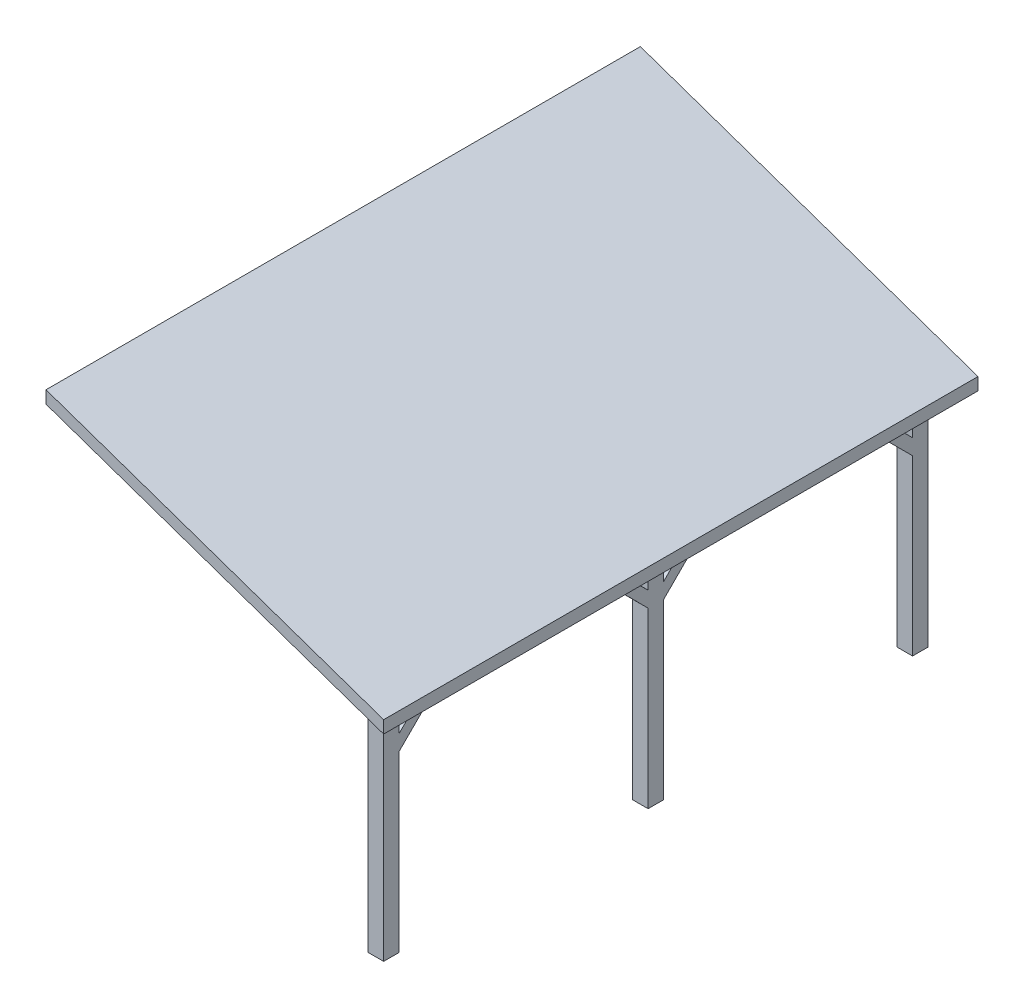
ISO-10303-21;
HEADER;
FILE_DESCRIPTION(('STEP AP214'),'2;1');
FILE_NAME('part.step','',(''),(''),'','','');
FILE_SCHEMA(('AUTOMOTIVE_DESIGN { 1 0 10303 214 1 1 1 1 }'));
ENDSEC;
DATA;
#1=APPLICATION_CONTEXT('core data for automotive mechanical design processes');
#2=APPLICATION_PROTOCOL_DEFINITION('international standard','automotive_design',2000,#1);
#3=PRODUCT_CONTEXT('',#1,'mechanical');
#4=PRODUCT('Part','Part','',(#3));
#5=PRODUCT_RELATED_PRODUCT_CATEGORY('part','',(#4));
#6=PRODUCT_DEFINITION_FORMATION('','',#4);
#7=PRODUCT_DEFINITION_CONTEXT('part definition',#1,'design');
#8=PRODUCT_DEFINITION('design','',#6,#7);
#9=PRODUCT_DEFINITION_SHAPE('','',#8);
#10=(LENGTH_UNIT() NAMED_UNIT(*) SI_UNIT(.MILLI.,.METRE.));
#11=(NAMED_UNIT(*) PLANE_ANGLE_UNIT() SI_UNIT($,.RADIAN.));
#12=(NAMED_UNIT(*) SI_UNIT($,.STERADIAN.) SOLID_ANGLE_UNIT());
#13=UNCERTAINTY_MEASURE_WITH_UNIT(LENGTH_MEASURE(1.E-05),#10,'distance_accuracy_value','');
#14=(GEOMETRIC_REPRESENTATION_CONTEXT(3) GLOBAL_UNCERTAINTY_ASSIGNED_CONTEXT((#13)) GLOBAL_UNIT_ASSIGNED_CONTEXT((#10,
#11,#12)) REPRESENTATION_CONTEXT('',''));
#15=CARTESIAN_POINT('',(0.,0.,0.));
#16=DIRECTION('',(0.,0.,1.));
#17=DIRECTION('',(1.,0.,0.));
#18=AXIS2_PLACEMENT_3D('',#15,#16,#17);
#19=CARTESIAN_POINT('',(21.66,0.,38.13));
#20=DIRECTION('',(0.,1.,0.));
#21=DIRECTION('',(-1.,0.,0.));
#22=AXIS2_PLACEMENT_3D('',#19,#20,#21);
#23=PLANE('',#22);
#24=DIRECTION('',(0.,0.,1.));
#25=VECTOR('',#24,1.);
#26=CARTESIAN_POINT('',(20.06,0.,0.));
#27=LINE('',#26,#25);
#28=CARTESIAN_POINT('',(20.06,0.,18.565));
#29=VERTEX_POINT('',#28);
#30=CARTESIAN_POINT('',(20.06,0.,19.565));
#31=VERTEX_POINT('',#30);
#32=EDGE_CURVE('E446',#29,#31,#27,.T.);
#33=ORIENTED_EDGE('',*,*,#32,.T.);
#34=DIRECTION('',(-1.,0.,0.));
#35=VECTOR('',#34,1.);
#36=CARTESIAN_POINT('',(20.06,0.,19.565));
#37=LINE('',#36,#35);
#38=CARTESIAN_POINT('',(19.06,0.,19.565));
#39=VERTEX_POINT('',#38);
#40=EDGE_CURVE('E369',#31,#39,#37,.T.);
#41=ORIENTED_EDGE('',*,*,#40,.T.);
#42=DIRECTION('',(0.,0.,1.));
#43=VECTOR('',#42,1.);
#44=CARTESIAN_POINT('',(19.06,0.,0.));
#45=LINE('',#44,#43);
#46=CARTESIAN_POINT('',(19.06,0.,18.565));
#47=VERTEX_POINT('',#46);
#48=EDGE_CURVE('E466',#47,#39,#45,.T.);
#49=ORIENTED_EDGE('',*,*,#48,.F.);
#50=DIRECTION('',(-1.,0.,0.));
#51=VECTOR('',#50,1.);
#52=CARTESIAN_POINT('',(21.661,0.,18.565));
#53=LINE('',#52,#51);
#54=EDGE_CURVE('E406',#29,#47,#53,.T.);
#55=ORIENTED_EDGE('',*,*,#54,.F.);
#56=EDGE_LOOP('',(#33,#41,#49,#55));
#57=FACE_BOUND('',#56,.T.);
#58=ADVANCED_FACE('F31',(#57),#23,.F.);
#59=CARTESIAN_POINT('',(20.06,0.,1.6));
#60=VERTEX_POINT('',#59);
#61=CARTESIAN_POINT('',(20.06,0.,2.6));
#62=VERTEX_POINT('',#61);
#63=EDGE_CURVE('E442',#60,#62,#27,.T.);
#64=ORIENTED_EDGE('',*,*,#63,.T.);
#65=DIRECTION('',(-1.,0.,0.));
#66=VECTOR('',#65,1.);
#67=CARTESIAN_POINT('',(21.661,0.,2.6));
#68=LINE('',#67,#66);
#69=CARTESIAN_POINT('',(19.06,0.,2.6));
#70=VERTEX_POINT('',#69);
#71=EDGE_CURVE('E407',#62,#70,#68,.T.);
#72=ORIENTED_EDGE('',*,*,#71,.T.);
#73=CARTESIAN_POINT('',(19.06,0.,1.6));
#74=VERTEX_POINT('',#73);
#75=EDGE_CURVE('E463',#74,#70,#45,.T.);
#76=ORIENTED_EDGE('',*,*,#75,.F.);
#77=DIRECTION('',(-1.,0.,0.));
#78=VECTOR('',#77,1.);
#79=CARTESIAN_POINT('',(19.06,0.,1.6));
#80=LINE('',#79,#78);
#81=EDGE_CURVE('E421',#60,#74,#80,.T.);
#82=ORIENTED_EDGE('',*,*,#81,.F.);
#83=EDGE_LOOP('',(#64,#72,#76,#82));
#84=FACE_BOUND('',#83,.T.);
#85=ADVANCED_FACE('F509',(#84),#23,.F.);
#86=CARTESIAN_POINT('',(19.06,0.,35.53));
#87=VERTEX_POINT('',#86);
#88=CARTESIAN_POINT('',(19.06,0.,36.53));
#89=VERTEX_POINT('',#88);
#90=EDGE_CURVE('E455',#87,#89,#45,.T.);
#91=ORIENTED_EDGE('',*,*,#90,.F.);
#92=DIRECTION('',(-1.,0.,0.));
#93=VECTOR('',#92,1.);
#94=CARTESIAN_POINT('',(20.06,0.,35.53));
#95=LINE('',#94,#93);
#96=CARTESIAN_POINT('',(20.06,0.,35.53));
#97=VERTEX_POINT('',#96);
#98=EDGE_CURVE('E356',#97,#87,#95,.T.);
#99=ORIENTED_EDGE('',*,*,#98,.F.);
#100=CARTESIAN_POINT('',(20.06,0.,36.53));
#101=VERTEX_POINT('',#100);
#102=EDGE_CURVE('E447',#97,#101,#27,.T.);
#103=ORIENTED_EDGE('',*,*,#102,.T.);
#104=DIRECTION('',(1.,0.,0.));
#105=VECTOR('',#104,1.);
#106=CARTESIAN_POINT('',(20.06,0.,36.53));
#107=LINE('',#106,#105);
#108=EDGE_CURVE('E432',#89,#101,#107,.T.);
#109=ORIENTED_EDGE('',*,*,#108,.F.);
#110=EDGE_LOOP('',(#91,#99,#103,#109));
#111=FACE_BOUND('',#110,.T.);
#112=ADVANCED_FACE('F33',(#111),#23,.F.);
#113=CARTESIAN_POINT('',(19.06,15.1302770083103,0.));
#114=DIRECTION('',(1.,0.,0.));
#115=DIRECTION('',(0.,1.,0.));
#116=AXIS2_PLACEMENT_3D('',#113,#114,#115);
#117=PLANE('',#116);
#118=DIRECTION('',(0.,1.,0.));
#119=VECTOR('',#118,1.);
#120=CARTESIAN_POINT('',(19.06,14.1302770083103,35.53));
#121=LINE('',#120,#119);
#122=CARTESIAN_POINT('',(19.06,12.1779442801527,35.53));
#123=VERTEX_POINT('',#122);
#124=CARTESIAN_POINT('',(19.06,14.1302770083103,35.53));
#125=VERTEX_POINT('',#124);
#126=EDGE_CURVE('E258',#123,#125,#121,.T.);
#127=ORIENTED_EDGE('',*,*,#126,.F.);
#128=DIRECTION('',(0.,-0.698527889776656,0.715582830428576));
#129=VECTOR('',#128,1.);
#130=CARTESIAN_POINT('',(19.06,12.1779442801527,35.53));
#131=LINE('',#130,#129);
#132=CARTESIAN_POINT('',(19.06,14.1302770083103,33.53));
#133=VERTEX_POINT('',#132);
#134=EDGE_CURVE('E46',#133,#123,#131,.T.);
#135=ORIENTED_EDGE('',*,*,#134,.F.);
#136=DIRECTION('',(0.,0.,-1.));
#137=VECTOR('',#136,1.);
#138=CARTESIAN_POINT('',(19.06,14.1302770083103,33.53));
#139=LINE('',#138,#137);
#140=EDGE_CURVE('E255',#125,#133,#139,.T.);
#141=ORIENTED_EDGE('',*,*,#140,.F.);
#142=EDGE_LOOP('',(#127,#135,#141));
#143=FACE_BOUND('',#142,.T.);
#144=DIRECTION('',(0.,0.,-1.));
#145=VECTOR('',#144,1.);
#146=CARTESIAN_POINT('',(19.06,14.1302770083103,19.565));
#147=LINE('',#146,#145);
#148=CARTESIAN_POINT('',(19.06,14.1302770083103,21.565));
#149=VERTEX_POINT('',#148);
#150=CARTESIAN_POINT('',(19.06,14.1302770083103,19.565));
#151=VERTEX_POINT('',#150);
#152=EDGE_CURVE('E280',#149,#151,#147,.T.);
#153=ORIENTED_EDGE('',*,*,#152,.F.);
#154=DIRECTION('',(0.,0.704832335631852,0.709373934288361));
#155=VECTOR('',#154,1.);
#156=CARTESIAN_POINT('',(19.06,14.1302770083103,21.565));
#157=LINE('',#156,#155);
#158=CARTESIAN_POINT('',(19.06,12.1430815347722,19.565));
#159=VERTEX_POINT('',#158);
#160=EDGE_CURVE('E266',#159,#149,#157,.T.);
#161=ORIENTED_EDGE('',*,*,#160,.F.);
#162=DIRECTION('',(0.,-1.,0.));
#163=VECTOR('',#162,1.);
#164=CARTESIAN_POINT('',(19.06,12.1430815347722,19.565));
#165=LINE('',#164,#163);
#166=EDGE_CURVE('E272',#151,#159,#165,.T.);
#167=ORIENTED_EDGE('',*,*,#166,.F.);
#168=EDGE_LOOP('',(#153,#161,#167));
#169=FACE_BOUND('',#168,.T.);
#170=DIRECTION('',(0.,1.,0.));
#171=VECTOR('',#170,1.);
#172=CARTESIAN_POINT('',(19.06,14.1302770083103,18.565));
#173=LINE('',#172,#171);
#174=CARTESIAN_POINT('',(19.06,12.1302770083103,18.565));
#175=VERTEX_POINT('',#174);
#176=CARTESIAN_POINT('',(19.06,14.1302770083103,18.565));
#177=VERTEX_POINT('',#176);
#178=EDGE_CURVE('E304',#175,#177,#173,.T.);
#179=ORIENTED_EDGE('',*,*,#178,.F.);
#180=DIRECTION('',(0.,-0.707106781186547,0.707106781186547));
#181=VECTOR('',#180,1.);
#182=CARTESIAN_POINT('',(19.06,12.1302770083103,18.565));
#183=LINE('',#182,#181);
#184=CARTESIAN_POINT('',(19.06,14.1302770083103,16.565));
#185=VERTEX_POINT('',#184);
#186=EDGE_CURVE('E287',#185,#175,#183,.T.);
#187=ORIENTED_EDGE('',*,*,#186,.F.);
#188=DIRECTION('',(0.,0.,-1.));
#189=VECTOR('',#188,1.);
#190=CARTESIAN_POINT('',(19.06,14.1302770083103,16.565));
#191=LINE('',#190,#189);
#192=EDGE_CURVE('E296',#177,#185,#191,.T.);
#193=ORIENTED_EDGE('',*,*,#192,.F.);
#194=EDGE_LOOP('',(#179,#187,#193));
#195=FACE_BOUND('',#194,.T.);
#196=DIRECTION('',(0.,0.707106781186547,0.707106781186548));
#197=VECTOR('',#196,1.);
#198=CARTESIAN_POINT('',(19.06,12.1302770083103,2.6));
#199=LINE('',#198,#197);
#200=CARTESIAN_POINT('',(19.06,12.1302770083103,2.6));
#201=VERTEX_POINT('',#200);
#202=CARTESIAN_POINT('',(19.06,14.1302770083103,4.6));
#203=VERTEX_POINT('',#202);
#204=EDGE_CURVE('E328',#201,#203,#199,.T.);
#205=ORIENTED_EDGE('',*,*,#204,.F.);
#206=DIRECTION('',(0.,-1.,0.));
#207=VECTOR('',#206,1.);
#208=CARTESIAN_POINT('',(19.06,14.1302770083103,2.6));
#209=LINE('',#208,#207);
#210=CARTESIAN_POINT('',(19.06,14.1302770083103,2.6));
#211=VERTEX_POINT('',#210);
#212=EDGE_CURVE('E311',#211,#201,#209,.T.);
#213=ORIENTED_EDGE('',*,*,#212,.F.);
#214=DIRECTION('',(0.,0.,-1.));
#215=VECTOR('',#214,1.);
#216=CARTESIAN_POINT('',(19.06,14.1302770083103,4.6));
#217=LINE('',#216,#215);
#218=EDGE_CURVE('E320',#203,#211,#217,.T.);
#219=ORIENTED_EDGE('',*,*,#218,.F.);
#220=EDGE_LOOP('',(#205,#213,#219));
#221=FACE_BOUND('',#220,.T.);
#222=ORIENTED_EDGE('',*,*,#48,.T.);
#223=DIRECTION('',(0.,-1.,0.));
#224=VECTOR('',#223,1.);
#225=CARTESIAN_POINT('',(19.06,0.,19.565));
#226=LINE('',#225,#224);
#227=CARTESIAN_POINT('',(19.06,11.1430815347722,19.565));
#228=VERTEX_POINT('',#227);
#229=EDGE_CURVE('E344',#228,#39,#226,.T.);
#230=ORIENTED_EDGE('',*,*,#229,.F.);
#231=DIRECTION('',(0.,-0.709158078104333,-0.705049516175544));
#232=VECTOR('',#231,1.);
#233=CARTESIAN_POINT('',(19.06,11.1430815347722,19.565));
#234=LINE('',#233,#232);
#235=CARTESIAN_POINT('',(19.06,14.1605635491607,22.565));
#236=VERTEX_POINT('',#235);
#237=EDGE_CURVE('E365',#236,#228,#234,.T.);
#238=ORIENTED_EDGE('',*,*,#237,.F.);
#239=DIRECTION('',(0.,0.,-1.));
#240=VECTOR('',#239,1.);
#241=CARTESIAN_POINT('',(19.06,14.1605635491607,22.565));
#242=LINE('',#241,#240);
#243=CARTESIAN_POINT('',(19.06,14.1605635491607,32.53));
#244=VERTEX_POINT('',#243);
#245=EDGE_CURVE('E362',#244,#236,#242,.T.);
#246=ORIENTED_EDGE('',*,*,#245,.F.);
#247=DIRECTION('',(0.,0.705049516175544,-0.709158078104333));
#248=VECTOR('',#247,1.);
#249=CARTESIAN_POINT('',(19.06,14.1605635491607,32.53));
#250=LINE('',#249,#248);
#251=CARTESIAN_POINT('',(19.06,11.1779442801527,35.53));
#252=VERTEX_POINT('',#251);
#253=EDGE_CURVE('E359',#252,#244,#250,.T.);
#254=ORIENTED_EDGE('',*,*,#253,.F.);
#255=DIRECTION('',(0.,1.,0.));
#256=VECTOR('',#255,1.);
#257=CARTESIAN_POINT('',(19.06,11.1779442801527,35.53));
#258=LINE('',#257,#256);
#259=EDGE_CURVE('E335',#87,#252,#258,.T.);
#260=ORIENTED_EDGE('',*,*,#259,.F.);
#261=ORIENTED_EDGE('',*,*,#90,.T.);
#262=DIRECTION('',(0.,-1.,0.));
#263=VECTOR('',#262,1.);
#264=CARTESIAN_POINT('',(19.06,0.,36.53));
#265=LINE('',#264,#263);
#266=CARTESIAN_POINT('',(19.06,15.1302770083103,36.53));
#267=VERTEX_POINT('',#266);
#268=EDGE_CURVE('E429',#267,#89,#265,.T.);
#269=ORIENTED_EDGE('',*,*,#268,.F.);
#270=DIRECTION('',(0.,0.,1.));
#271=VECTOR('',#270,1.);
#272=CARTESIAN_POINT('',(19.06,15.1302770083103,0.));
#273=LINE('',#272,#271);
#274=CARTESIAN_POINT('',(19.06,15.1302770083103,1.6));
#275=VERTEX_POINT('',#274);
#276=EDGE_CURVE('E461',#275,#267,#273,.T.);
#277=ORIENTED_EDGE('',*,*,#276,.F.);
#278=DIRECTION('',(0.,1.,0.));
#279=VECTOR('',#278,1.);
#280=CARTESIAN_POINT('',(19.06,15.1302770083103,1.6));
#281=LINE('',#280,#279);
#282=EDGE_CURVE('E423',#74,#275,#281,.T.);
#283=ORIENTED_EDGE('',*,*,#282,.F.);
#284=ORIENTED_EDGE('',*,*,#75,.T.);
#285=DIRECTION('',(0.,-1.,0.));
#286=VECTOR('',#285,1.);
#287=CARTESIAN_POINT('',(19.06,0.,2.6));
#288=LINE('',#287,#286);
#289=CARTESIAN_POINT('',(19.06,11.1302770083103,2.6));
#290=VERTEX_POINT('',#289);
#291=EDGE_CURVE('E404',#290,#70,#288,.T.);
#292=ORIENTED_EDGE('',*,*,#291,.F.);
#293=DIRECTION('',(0.,-0.707106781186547,-0.707106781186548));
#294=VECTOR('',#293,1.);
#295=CARTESIAN_POINT('',(19.06,11.1302770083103,2.6));
#296=LINE('',#295,#294);
#297=CARTESIAN_POINT('',(19.06,14.1302770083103,5.6));
#298=VERTEX_POINT('',#297);
#299=EDGE_CURVE('E401',#298,#290,#296,.T.);
#300=ORIENTED_EDGE('',*,*,#299,.F.);
#301=DIRECTION('',(0.,0.,-1.));
#302=VECTOR('',#301,1.);
#303=CARTESIAN_POINT('',(19.06,14.1302770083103,5.6));
#304=LINE('',#303,#302);
#305=CARTESIAN_POINT('',(19.06,14.1302770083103,15.565));
#306=VERTEX_POINT('',#305);
#307=EDGE_CURVE('E398',#306,#298,#304,.T.);
#308=ORIENTED_EDGE('',*,*,#307,.F.);
#309=DIRECTION('',(0.,0.707106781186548,-0.707106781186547));
#310=VECTOR('',#309,1.);
#311=CARTESIAN_POINT('',(19.06,14.1302770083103,15.565));
#312=LINE('',#311,#310);
#313=CARTESIAN_POINT('',(19.06,11.1302770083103,18.565));
#314=VERTEX_POINT('',#313);
#315=EDGE_CURVE('E395',#314,#306,#312,.T.);
#316=ORIENTED_EDGE('',*,*,#315,.F.);
#317=DIRECTION('',(0.,1.,0.));
#318=VECTOR('',#317,1.);
#319=CARTESIAN_POINT('',(19.06,11.1302770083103,18.565));
#320=LINE('',#319,#318);
#321=EDGE_CURVE('E392',#47,#314,#320,.T.);
#322=ORIENTED_EDGE('',*,*,#321,.F.);
#323=EDGE_LOOP('',(#222,#230,#238,#246,#254,#260,#261,#269,#277,#283,#284,#292,#300,#308,#316,#322));
#324=FACE_BOUND('',#323,.T.);
#325=ADVANCED_FACE('F517',(#143,#169,#195,#221,#324),#117,.F.);
#326=CARTESIAN_POINT('',(20.06,0.,0.));
#327=DIRECTION('',(-1.,0.,0.));
#328=DIRECTION('',(0.,0.,1.));
#329=AXIS2_PLACEMENT_3D('',#326,#327,#328);
#330=PLANE('',#329);
#331=DIRECTION('',(0.,0.,-1.));
#332=VECTOR('',#331,1.);
#333=CARTESIAN_POINT('',(20.06,14.1302770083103,33.53));
#334=LINE('',#333,#332);
#335=CARTESIAN_POINT('',(20.06,14.1302770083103,35.53));
#336=VERTEX_POINT('',#335);
#337=CARTESIAN_POINT('',(20.06,14.1302770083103,33.53));
#338=VERTEX_POINT('',#337);
#339=EDGE_CURVE('E54',#336,#338,#334,.T.);
#340=ORIENTED_EDGE('',*,*,#339,.T.);
#341=DIRECTION('',(0.,-0.698527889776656,0.715582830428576));
#342=VECTOR('',#341,1.);
#343=CARTESIAN_POINT('',(20.06,12.1779442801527,35.53));
#344=LINE('',#343,#342);
#345=CARTESIAN_POINT('',(20.06,12.1779442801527,35.53));
#346=VERTEX_POINT('',#345);
#347=EDGE_CURVE('E242',#338,#346,#344,.T.);
#348=ORIENTED_EDGE('',*,*,#347,.T.);
#349=DIRECTION('',(0.,1.,0.));
#350=VECTOR('',#349,1.);
#351=CARTESIAN_POINT('',(20.06,14.1302770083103,35.53));
#352=LINE('',#351,#350);
#353=EDGE_CURVE('E249',#346,#336,#352,.T.);
#354=ORIENTED_EDGE('',*,*,#353,.T.);
#355=EDGE_LOOP('',(#340,#348,#354));
#356=FACE_BOUND('',#355,.T.);
#357=DIRECTION('',(0.,-1.,0.));
#358=VECTOR('',#357,1.);
#359=CARTESIAN_POINT('',(20.06,12.1430815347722,19.565));
#360=LINE('',#359,#358);
#361=CARTESIAN_POINT('',(20.06,14.1302770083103,19.565));
#362=VERTEX_POINT('',#361);
#363=CARTESIAN_POINT('',(20.06,12.1430815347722,19.565));
#364=VERTEX_POINT('',#363);
#365=EDGE_CURVE('E275',#362,#364,#360,.T.);
#366=ORIENTED_EDGE('',*,*,#365,.T.);
#367=DIRECTION('',(0.,0.704832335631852,0.709373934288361));
#368=VECTOR('',#367,1.);
#369=CARTESIAN_POINT('',(20.06,14.1302770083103,21.565));
#370=LINE('',#369,#368);
#371=CARTESIAN_POINT('',(20.06,14.1302770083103,21.565));
#372=VERTEX_POINT('',#371);
#373=EDGE_CURVE('E268',#364,#372,#370,.T.);
#374=ORIENTED_EDGE('',*,*,#373,.T.);
#375=DIRECTION('',(0.,0.,-1.));
#376=VECTOR('',#375,1.);
#377=CARTESIAN_POINT('',(20.06,14.1302770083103,19.565));
#378=LINE('',#377,#376);
#379=EDGE_CURVE('E271',#372,#362,#378,.T.);
#380=ORIENTED_EDGE('',*,*,#379,.T.);
#381=EDGE_LOOP('',(#366,#374,#380));
#382=FACE_BOUND('',#381,.T.);
#383=DIRECTION('',(0.,0.,-1.));
#384=VECTOR('',#383,1.);
#385=CARTESIAN_POINT('',(20.06,14.1302770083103,16.565));
#386=LINE('',#385,#384);
#387=CARTESIAN_POINT('',(20.06,14.1302770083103,18.565));
#388=VERTEX_POINT('',#387);
#389=CARTESIAN_POINT('',(20.06,14.1302770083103,16.565));
#390=VERTEX_POINT('',#389);
#391=EDGE_CURVE('E299',#388,#390,#386,.T.);
#392=ORIENTED_EDGE('',*,*,#391,.T.);
#393=DIRECTION('',(0.,-0.707106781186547,0.707106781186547));
#394=VECTOR('',#393,1.);
#395=CARTESIAN_POINT('',(20.06,12.1302770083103,18.565));
#396=LINE('',#395,#394);
#397=CARTESIAN_POINT('',(20.06,12.1302770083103,18.565));
#398=VERTEX_POINT('',#397);
#399=EDGE_CURVE('E292',#390,#398,#396,.T.);
#400=ORIENTED_EDGE('',*,*,#399,.T.);
#401=DIRECTION('',(0.,1.,0.));
#402=VECTOR('',#401,1.);
#403=CARTESIAN_POINT('',(20.06,14.1302770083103,18.565));
#404=LINE('',#403,#402);
#405=EDGE_CURVE('E295',#398,#388,#404,.T.);
#406=ORIENTED_EDGE('',*,*,#405,.T.);
#407=EDGE_LOOP('',(#392,#400,#406));
#408=FACE_BOUND('',#407,.T.);
#409=DIRECTION('',(0.,0.,-1.));
#410=VECTOR('',#409,1.);
#411=CARTESIAN_POINT('',(20.06,14.1302770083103,4.6));
#412=LINE('',#411,#410);
#413=CARTESIAN_POINT('',(20.06,14.1302770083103,4.6));
#414=VERTEX_POINT('',#413);
#415=CARTESIAN_POINT('',(20.06,14.1302770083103,2.6));
#416=VERTEX_POINT('',#415);
#417=EDGE_CURVE('E323',#414,#416,#412,.T.);
#418=ORIENTED_EDGE('',*,*,#417,.T.);
#419=DIRECTION('',(0.,-1.,0.));
#420=VECTOR('',#419,1.);
#421=CARTESIAN_POINT('',(20.06,14.1302770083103,2.6));
#422=LINE('',#421,#420);
#423=CARTESIAN_POINT('',(20.06,12.1302770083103,2.6));
#424=VERTEX_POINT('',#423);
#425=EDGE_CURVE('E316',#416,#424,#422,.T.);
#426=ORIENTED_EDGE('',*,*,#425,.T.);
#427=DIRECTION('',(0.,0.707106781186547,0.707106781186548));
#428=VECTOR('',#427,1.);
#429=CARTESIAN_POINT('',(20.06,12.1302770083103,2.6));
#430=LINE('',#429,#428);
#431=EDGE_CURVE('E319',#424,#414,#430,.T.);
#432=ORIENTED_EDGE('',*,*,#431,.T.);
#433=EDGE_LOOP('',(#418,#426,#432));
#434=FACE_BOUND('',#433,.T.);
#435=DIRECTION('',(0.,-0.709158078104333,-0.705049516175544));
#436=VECTOR('',#435,1.);
#437=CARTESIAN_POINT('',(20.06,11.1430815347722,19.565));
#438=LINE('',#437,#436);
#439=CARTESIAN_POINT('',(20.06,14.1605635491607,22.565));
#440=VERTEX_POINT('',#439);
#441=CARTESIAN_POINT('',(20.06,11.1430815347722,19.565));
#442=VERTEX_POINT('',#441);
#443=EDGE_CURVE('E350',#440,#442,#438,.T.);
#444=ORIENTED_EDGE('',*,*,#443,.T.);
#445=DIRECTION('',(0.,-1.,0.));
#446=VECTOR('',#445,1.);
#447=CARTESIAN_POINT('',(20.06,0.,19.565));
#448=LINE('',#447,#446);
#449=EDGE_CURVE('E353',#442,#31,#448,.T.);
#450=ORIENTED_EDGE('',*,*,#449,.T.);
#451=ORIENTED_EDGE('',*,*,#32,.F.);
#452=DIRECTION('',(0.,-1.,0.));
#453=VECTOR('',#452,1.);
#454=CARTESIAN_POINT('',(20.06,11.1302770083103,18.565));
#455=LINE('',#454,#453);
#456=CARTESIAN_POINT('',(20.06,11.1302770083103,18.565));
#457=VERTEX_POINT('',#456);
#458=EDGE_CURVE('E410',#457,#29,#455,.T.);
#459=ORIENTED_EDGE('',*,*,#458,.F.);
#460=DIRECTION('',(0.,-0.707106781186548,0.707106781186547));
#461=VECTOR('',#460,1.);
#462=CARTESIAN_POINT('',(20.06,14.1302770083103,15.565));
#463=LINE('',#462,#461);
#464=CARTESIAN_POINT('',(20.06,14.1302770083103,15.565));
#465=VERTEX_POINT('',#464);
#466=EDGE_CURVE('E372',#465,#457,#463,.T.);
#467=ORIENTED_EDGE('',*,*,#466,.F.);
#468=DIRECTION('',(0.,0.,1.));
#469=VECTOR('',#468,1.);
#470=CARTESIAN_POINT('',(20.06,14.1302770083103,5.6));
#471=LINE('',#470,#469);
#472=CARTESIAN_POINT('',(20.06,14.1302770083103,5.6));
#473=VERTEX_POINT('',#472);
#474=EDGE_CURVE('E383',#473,#465,#471,.T.);
#475=ORIENTED_EDGE('',*,*,#474,.F.);
#476=DIRECTION('',(0.,0.707106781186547,0.707106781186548));
#477=VECTOR('',#476,1.);
#478=CARTESIAN_POINT('',(20.06,11.1302770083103,2.6));
#479=LINE('',#478,#477);
#480=CARTESIAN_POINT('',(20.06,11.1302770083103,2.6));
#481=VERTEX_POINT('',#480);
#482=EDGE_CURVE('E386',#481,#473,#479,.T.);
#483=ORIENTED_EDGE('',*,*,#482,.F.);
#484=DIRECTION('',(0.,1.,0.));
#485=VECTOR('',#484,1.);
#486=CARTESIAN_POINT('',(20.06,0.,2.6));
#487=LINE('',#486,#485);
#488=EDGE_CURVE('E389',#62,#481,#487,.T.);
#489=ORIENTED_EDGE('',*,*,#488,.F.);
#490=ORIENTED_EDGE('',*,*,#63,.F.);
#491=DIRECTION('',(0.,-1.,0.));
#492=VECTOR('',#491,1.);
#493=CARTESIAN_POINT('',(20.06,0.,1.6));
#494=LINE('',#493,#492);
#495=CARTESIAN_POINT('',(20.06,14.7840166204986,1.6));
#496=VERTEX_POINT('',#495);
#497=EDGE_CURVE('E427',#496,#60,#494,.T.);
#498=ORIENTED_EDGE('',*,*,#497,.F.);
#499=DIRECTION('',(0.,0.,1.));
#500=VECTOR('',#499,1.);
#501=CARTESIAN_POINT('',(20.06,14.7840166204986,0.));
#502=LINE('',#501,#500);
#503=CARTESIAN_POINT('',(20.06,14.7840166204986,36.53));
#504=VERTEX_POINT('',#503);
#505=EDGE_CURVE('E448',#496,#504,#502,.T.);
#506=ORIENTED_EDGE('',*,*,#505,.T.);
#507=DIRECTION('',(0.,1.,0.));
#508=VECTOR('',#507,1.);
#509=CARTESIAN_POINT('',(20.06,14.7840166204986,36.53));
#510=LINE('',#509,#508);
#511=EDGE_CURVE('E435',#101,#504,#510,.T.);
#512=ORIENTED_EDGE('',*,*,#511,.F.);
#513=ORIENTED_EDGE('',*,*,#102,.F.);
#514=DIRECTION('',(0.,1.,0.));
#515=VECTOR('',#514,1.);
#516=CARTESIAN_POINT('',(20.06,11.1779442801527,35.53));
#517=LINE('',#516,#515);
#518=CARTESIAN_POINT('',(20.06,11.1779442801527,35.53));
#519=VERTEX_POINT('',#518);
#520=EDGE_CURVE('E340',#97,#519,#517,.T.);
#521=ORIENTED_EDGE('',*,*,#520,.T.);
#522=DIRECTION('',(0.,0.705049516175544,-0.709158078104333));
#523=VECTOR('',#522,1.);
#524=CARTESIAN_POINT('',(20.06,14.1605635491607,32.53));
#525=LINE('',#524,#523);
#526=CARTESIAN_POINT('',(20.06,14.1605635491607,32.53));
#527=VERTEX_POINT('',#526);
#528=EDGE_CURVE('E343',#519,#527,#525,.T.);
#529=ORIENTED_EDGE('',*,*,#528,.T.);
#530=DIRECTION('',(0.,0.,-1.));
#531=VECTOR('',#530,1.);
#532=CARTESIAN_POINT('',(20.06,14.1605635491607,22.565));
#533=LINE('',#532,#531);
#534=EDGE_CURVE('E347',#527,#440,#533,.T.);
#535=ORIENTED_EDGE('',*,*,#534,.T.);
#536=EDGE_LOOP('',(#444,#450,#451,#459,#467,#475,#483,#489,#490,#498,#506,#512,#513,#521,#529,#535));
#537=FACE_BOUND('',#536,.T.);
#538=ADVANCED_FACE('F253',(#356,#382,#408,#434,#537),#330,.F.);
#539=CARTESIAN_POINT('',(21.66,15.03,38.13));
#540=DIRECTION('',(-1.,0.,0.));
#541=DIRECTION('',(0.,-1.,0.));
#542=AXIS2_PLACEMENT_3D('',#539,#540,#541);
#543=PLANE('',#542);
#544=DIRECTION('',(0.,1.,0.));
#545=VECTOR('',#544,1.);
#546=CARTESIAN_POINT('',(21.66,15.03,38.13));
#547=LINE('',#546,#545);
#548=CARTESIAN_POINT('',(21.66,14.23,38.13));
#549=VERTEX_POINT('',#548);
#550=CARTESIAN_POINT('',(21.66,15.03,38.13));
#551=VERTEX_POINT('',#550);
#552=EDGE_CURVE('E467',#549,#551,#547,.T.);
#553=ORIENTED_EDGE('',*,*,#552,.F.);
#554=DIRECTION('',(0.,0.,1.));
#555=VECTOR('',#554,1.);
#556=CARTESIAN_POINT('',(21.66,14.23,0.));
#557=LINE('',#556,#555);
#558=CARTESIAN_POINT('',(21.66,14.23,0.));
#559=VERTEX_POINT('',#558);
#560=EDGE_CURVE('E441',#559,#549,#557,.T.);
#561=ORIENTED_EDGE('',*,*,#560,.F.);
#562=DIRECTION('',(0.,1.,0.));
#563=VECTOR('',#562,1.);
#564=CARTESIAN_POINT('',(21.66,15.03,0.));
#565=LINE('',#564,#563);
#566=CARTESIAN_POINT('',(21.66,15.03,0.));
#567=VERTEX_POINT('',#566);
#568=EDGE_CURVE('E460',#559,#567,#565,.T.);
#569=ORIENTED_EDGE('',*,*,#568,.T.);
#570=DIRECTION('',(0.,0.,-1.));
#571=VECTOR('',#570,1.);
#572=CARTESIAN_POINT('',(21.66,15.03,38.13));
#573=LINE('',#572,#571);
#574=EDGE_CURVE('E11',#551,#567,#573,.T.);
#575=ORIENTED_EDGE('',*,*,#574,.F.);
#576=EDGE_LOOP('',(#553,#561,#569,#575));
#577=FACE_BOUND('',#576,.T.);
#578=ADVANCED_FACE('F496',(#577),#543,.F.);
#579=CARTESIAN_POINT('',(0.,22.53,38.13));
#580=DIRECTION('',(-0.327200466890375,-0.944954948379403,0.));
#581=DIRECTION('',(0.944954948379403,-0.327200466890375,0.));
#582=AXIS2_PLACEMENT_3D('',#579,#580,#581);
#583=PLANE('',#582);
#584=DIRECTION('',(-0.944954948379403,0.327200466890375,0.));
#585=VECTOR('',#584,1.);
#586=CARTESIAN_POINT('',(0.,22.53,0.));
#587=LINE('',#586,#585);
#588=CARTESIAN_POINT('',(0.,22.53,0.));
#589=VERTEX_POINT('',#588);
#590=EDGE_CURVE('E476',#567,#589,#587,.T.);
#591=ORIENTED_EDGE('',*,*,#590,.T.);
#592=DIRECTION('',(0.,0.,-1.));
#593=VECTOR('',#592,1.);
#594=CARTESIAN_POINT('',(0.,22.53,38.13));
#595=LINE('',#594,#593);
#596=CARTESIAN_POINT('',(0.,22.53,38.13));
#597=VERTEX_POINT('',#596);
#598=EDGE_CURVE('E39',#597,#589,#595,.T.);
#599=ORIENTED_EDGE('',*,*,#598,.F.);
#600=DIRECTION('',(-0.944954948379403,0.327200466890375,0.));
#601=VECTOR('',#600,1.);
#602=CARTESIAN_POINT('',(0.,22.53,38.13));
#603=LINE('',#602,#601);
#604=EDGE_CURVE('E469',#551,#597,#603,.T.);
#605=ORIENTED_EDGE('',*,*,#604,.F.);
#606=ORIENTED_EDGE('',*,*,#574,.T.);
#607=EDGE_LOOP('',(#591,#599,#605,#606));
#608=FACE_BOUND('',#607,.T.);
#609=ADVANCED_FACE('F500',(#608),#583,.F.);
#610=CARTESIAN_POINT('',(0.,0.,38.13));
#611=DIRECTION('',(1.,0.,0.));
#612=DIRECTION('',(0.,0.,-1.));
#613=AXIS2_PLACEMENT_3D('',#610,#611,#612);
#614=PLANE('',#613);
#615=DIRECTION('',(0.,-1.,0.));
#616=VECTOR('',#615,1.);
#617=CARTESIAN_POINT('',(0.,0.,0.));
#618=LINE('',#617,#616);
#619=CARTESIAN_POINT('',(0.,21.73,0.));
#620=VERTEX_POINT('',#619);
#621=EDGE_CURVE('E470',#589,#620,#618,.T.);
#622=ORIENTED_EDGE('',*,*,#621,.T.);
#623=DIRECTION('',(0.,0.,1.));
#624=VECTOR('',#623,1.);
#625=CARTESIAN_POINT('',(0.,21.73,0.));
#626=LINE('',#625,#624);
#627=CARTESIAN_POINT('',(0.,21.73,38.13));
#628=VERTEX_POINT('',#627);
#629=EDGE_CURVE('E457',#620,#628,#626,.T.);
#630=ORIENTED_EDGE('',*,*,#629,.T.);
#631=DIRECTION('',(0.,-1.,0.));
#632=VECTOR('',#631,1.);
#633=CARTESIAN_POINT('',(0.,0.,38.13));
#634=LINE('',#633,#632);
#635=EDGE_CURVE('E472',#597,#628,#634,.T.);
#636=ORIENTED_EDGE('',*,*,#635,.F.);
#637=ORIENTED_EDGE('',*,*,#598,.T.);
#638=EDGE_LOOP('',(#622,#630,#636,#637));
#639=FACE_BOUND('',#638,.T.);
#640=ADVANCED_FACE('F484',(#639),#614,.F.);
#641=CARTESIAN_POINT('',(0.,0.,38.13));
#642=DIRECTION('',(0.,0.,-1.));
#643=DIRECTION('',(-1.,0.,0.));
#644=AXIS2_PLACEMENT_3D('',#641,#642,#643);
#645=PLANE('',#644);
#646=DIRECTION('',(-0.944954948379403,0.327200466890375,0.));
#647=VECTOR('',#646,1.);
#648=CARTESIAN_POINT('',(0.,21.73,38.13));
#649=LINE('',#648,#647);
#650=EDGE_CURVE('E445',#549,#628,#649,.T.);
#651=ORIENTED_EDGE('',*,*,#650,.F.);
#652=ORIENTED_EDGE('',*,*,#552,.T.);
#653=ORIENTED_EDGE('',*,*,#604,.T.);
#654=ORIENTED_EDGE('',*,*,#635,.T.);
#655=EDGE_LOOP('',(#651,#652,#653,#654));
#656=FACE_BOUND('',#655,.T.);
#657=ADVANCED_FACE('F499',(#656),#645,.F.);
#658=CARTESIAN_POINT('',(0.,0.,0.));
#659=DIRECTION('',(0.,0.,-1.));
#660=DIRECTION('',(-1.,0.,0.));
#661=AXIS2_PLACEMENT_3D('',#658,#659,#660);
#662=PLANE('',#661);
#663=ORIENTED_EDGE('',*,*,#568,.F.);
#664=DIRECTION('',(-0.944954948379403,0.327200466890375,0.));
#665=VECTOR('',#664,1.);
#666=CARTESIAN_POINT('',(0.,21.73,0.));
#667=LINE('',#666,#665);
#668=EDGE_CURVE('E452',#559,#620,#667,.T.);
#669=ORIENTED_EDGE('',*,*,#668,.T.);
#670=ORIENTED_EDGE('',*,*,#621,.F.);
#671=ORIENTED_EDGE('',*,*,#590,.F.);
#672=EDGE_LOOP('',(#663,#669,#670,#671));
#673=FACE_BOUND('',#672,.T.);
#674=ADVANCED_FACE('F490',(#673),#662,.T.);
#675=CARTESIAN_POINT('',(0.,21.73,0.));
#676=DIRECTION('',(0.327200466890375,0.944954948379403,0.));
#677=DIRECTION('',(-0.944954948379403,0.327200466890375,0.));
#678=AXIS2_PLACEMENT_3D('',#675,#676,#677);
#679=PLANE('',#678);
#680=ORIENTED_EDGE('',*,*,#505,.F.);
#681=DIRECTION('',(0.944954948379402,-0.327200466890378,0.));
#682=VECTOR('',#681,1.);
#683=CARTESIAN_POINT('',(20.06,14.7840166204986,1.6));
#684=LINE('',#683,#682);
#685=EDGE_CURVE('E425',#275,#496,#684,.T.);
#686=ORIENTED_EDGE('',*,*,#685,.F.);
#687=ORIENTED_EDGE('',*,*,#276,.T.);
#688=DIRECTION('',(-0.944954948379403,0.327200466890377,0.));
#689=VECTOR('',#688,1.);
#690=CARTESIAN_POINT('',(19.06,15.1302770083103,36.53));
#691=LINE('',#690,#689);
#692=EDGE_CURVE('E438',#504,#267,#691,.T.);
#693=ORIENTED_EDGE('',*,*,#692,.F.);
#694=EDGE_LOOP('',(#680,#686,#687,#693));
#695=FACE_BOUND('',#694,.T.);
#696=ORIENTED_EDGE('',*,*,#650,.T.);
#697=ORIENTED_EDGE('',*,*,#629,.F.);
#698=ORIENTED_EDGE('',*,*,#668,.F.);
#699=ORIENTED_EDGE('',*,*,#560,.T.);
#700=EDGE_LOOP('',(#696,#697,#698,#699));
#701=FACE_BOUND('',#700,.T.);
#702=ADVANCED_FACE('F493',(#695,#701),#679,.F.);
#703=CARTESIAN_POINT('',(19.06,0.,36.53));
#704=DIRECTION('',(0.,0.,1.));
#705=DIRECTION('',(1.,0.,0.));
#706=AXIS2_PLACEMENT_3D('',#703,#704,#705);
#707=PLANE('',#706);
#708=ORIENTED_EDGE('',*,*,#268,.T.);
#709=ORIENTED_EDGE('',*,*,#108,.T.);
#710=ORIENTED_EDGE('',*,*,#511,.T.);
#711=ORIENTED_EDGE('',*,*,#692,.T.);
#712=EDGE_LOOP('',(#708,#709,#710,#711));
#713=FACE_BOUND('',#712,.T.);
#714=ADVANCED_FACE('F559',(#713),#707,.T.);
#715=CARTESIAN_POINT('',(19.06,0.,1.6));
#716=DIRECTION('',(0.,0.,-1.));
#717=DIRECTION('',(-1.,0.,0.));
#718=AXIS2_PLACEMENT_3D('',#715,#716,#717);
#719=PLANE('',#718);
#720=ORIENTED_EDGE('',*,*,#81,.T.);
#721=ORIENTED_EDGE('',*,*,#282,.T.);
#722=ORIENTED_EDGE('',*,*,#685,.T.);
#723=ORIENTED_EDGE('',*,*,#497,.T.);
#724=EDGE_LOOP('',(#720,#721,#722,#723));
#725=FACE_BOUND('',#724,.T.);
#726=ADVANCED_FACE('F569',(#725),#719,.T.);
#727=CARTESIAN_POINT('',(21.661,0.,2.6));
#728=DIRECTION('',(0.,0.,-1.));
#729=DIRECTION('',(-1.,0.,0.));
#730=AXIS2_PLACEMENT_3D('',#727,#728,#729);
#731=PLANE('',#730);
#732=ORIENTED_EDGE('',*,*,#488,.T.);
#733=DIRECTION('',(-1.,0.,0.));
#734=VECTOR('',#733,1.);
#735=CARTESIAN_POINT('',(21.661,11.1302770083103,2.6));
#736=LINE('',#735,#734);
#737=EDGE_CURVE('E411',#481,#290,#736,.T.);
#738=ORIENTED_EDGE('',*,*,#737,.T.);
#739=ORIENTED_EDGE('',*,*,#291,.T.);
#740=ORIENTED_EDGE('',*,*,#71,.F.);
#741=EDGE_LOOP('',(#732,#738,#739,#740));
#742=FACE_BOUND('',#741,.T.);
#743=ADVANCED_FACE('F578',(#742),#731,.F.);
#744=CARTESIAN_POINT('',(21.661,11.1302770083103,2.6));
#745=DIRECTION('',(0.,0.707106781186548,-0.707106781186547));
#746=DIRECTION('',(0.,0.707106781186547,0.707106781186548));
#747=AXIS2_PLACEMENT_3D('',#744,#745,#746);
#748=PLANE('',#747);
#749=ORIENTED_EDGE('',*,*,#482,.T.);
#750=DIRECTION('',(-1.,0.,0.));
#751=VECTOR('',#750,1.);
#752=CARTESIAN_POINT('',(21.661,14.1302770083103,5.6));
#753=LINE('',#752,#751);
#754=EDGE_CURVE('E413',#473,#298,#753,.T.);
#755=ORIENTED_EDGE('',*,*,#754,.T.);
#756=ORIENTED_EDGE('',*,*,#299,.T.);
#757=ORIENTED_EDGE('',*,*,#737,.F.);
#758=EDGE_LOOP('',(#749,#755,#756,#757));
#759=FACE_BOUND('',#758,.T.);
#760=ADVANCED_FACE('F580',(#759),#748,.F.);
#761=CARTESIAN_POINT('',(21.661,14.1302770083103,5.6));
#762=DIRECTION('',(0.,1.,0.));
#763=DIRECTION('',(-1.,0.,0.));
#764=AXIS2_PLACEMENT_3D('',#761,#762,#763);
#765=PLANE('',#764);
#766=ORIENTED_EDGE('',*,*,#474,.T.);
#767=DIRECTION('',(-1.,0.,0.));
#768=VECTOR('',#767,1.);
#769=CARTESIAN_POINT('',(21.661,14.1302770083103,15.565));
#770=LINE('',#769,#768);
#771=EDGE_CURVE('E415',#465,#306,#770,.T.);
#772=ORIENTED_EDGE('',*,*,#771,.T.);
#773=ORIENTED_EDGE('',*,*,#307,.T.);
#774=ORIENTED_EDGE('',*,*,#754,.F.);
#775=EDGE_LOOP('',(#766,#772,#773,#774));
#776=FACE_BOUND('',#775,.T.);
#777=ADVANCED_FACE('F583',(#776),#765,.F.);
#778=CARTESIAN_POINT('',(21.661,14.1302770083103,15.565));
#779=DIRECTION('',(0.,0.707106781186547,0.707106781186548));
#780=DIRECTION('',(0.,-0.707106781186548,0.707106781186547));
#781=AXIS2_PLACEMENT_3D('',#778,#779,#780);
#782=PLANE('',#781);
#783=ORIENTED_EDGE('',*,*,#466,.T.);
#784=DIRECTION('',(-1.,0.,0.));
#785=VECTOR('',#784,1.);
#786=CARTESIAN_POINT('',(21.661,11.1302770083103,18.565));
#787=LINE('',#786,#785);
#788=EDGE_CURVE('E417',#457,#314,#787,.T.);
#789=ORIENTED_EDGE('',*,*,#788,.T.);
#790=ORIENTED_EDGE('',*,*,#315,.T.);
#791=ORIENTED_EDGE('',*,*,#771,.F.);
#792=EDGE_LOOP('',(#783,#789,#790,#791));
#793=FACE_BOUND('',#792,.T.);
#794=ADVANCED_FACE('F585',(#793),#782,.F.);
#795=CARTESIAN_POINT('',(21.661,11.1302770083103,18.565));
#796=DIRECTION('',(0.,0.,1.));
#797=DIRECTION('',(1.,0.,0.));
#798=AXIS2_PLACEMENT_3D('',#795,#796,#797);
#799=PLANE('',#798);
#800=ORIENTED_EDGE('',*,*,#458,.T.);
#801=ORIENTED_EDGE('',*,*,#54,.T.);
#802=ORIENTED_EDGE('',*,*,#321,.T.);
#803=ORIENTED_EDGE('',*,*,#788,.F.);
#804=EDGE_LOOP('',(#800,#801,#802,#803));
#805=FACE_BOUND('',#804,.T.);
#806=ADVANCED_FACE('F589',(#805),#799,.F.);
#807=CARTESIAN_POINT('',(20.06,0.,19.565));
#808=DIRECTION('',(0.,0.,-1.));
#809=DIRECTION('',(-1.,0.,0.));
#810=AXIS2_PLACEMENT_3D('',#807,#808,#809);
#811=PLANE('',#810);
#812=ORIENTED_EDGE('',*,*,#229,.T.);
#813=ORIENTED_EDGE('',*,*,#40,.F.);
#814=ORIENTED_EDGE('',*,*,#449,.F.);
#815=DIRECTION('',(-1.,0.,0.));
#816=VECTOR('',#815,1.);
#817=CARTESIAN_POINT('',(20.06,11.1430815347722,19.565));
#818=LINE('',#817,#816);
#819=EDGE_CURVE('E373',#442,#228,#818,.T.);
#820=ORIENTED_EDGE('',*,*,#819,.T.);
#821=EDGE_LOOP('',(#812,#813,#814,#820));
#822=FACE_BOUND('',#821,.T.);
#823=ADVANCED_FACE('F541',(#822),#811,.F.);
#824=CARTESIAN_POINT('',(20.06,11.1430815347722,19.565));
#825=DIRECTION('',(0.,0.705049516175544,-0.709158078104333));
#826=DIRECTION('',(0.,0.709158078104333,0.705049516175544));
#827=AXIS2_PLACEMENT_3D('',#824,#825,#826);
#828=PLANE('',#827);
#829=ORIENTED_EDGE('',*,*,#237,.T.);
#830=ORIENTED_EDGE('',*,*,#819,.F.);
#831=ORIENTED_EDGE('',*,*,#443,.F.);
#832=DIRECTION('',(-1.,0.,0.));
#833=VECTOR('',#832,1.);
#834=CARTESIAN_POINT('',(20.06,14.1605635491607,22.565));
#835=LINE('',#834,#833);
#836=EDGE_CURVE('E375',#440,#236,#835,.T.);
#837=ORIENTED_EDGE('',*,*,#836,.T.);
#838=EDGE_LOOP('',(#829,#830,#831,#837));
#839=FACE_BOUND('',#838,.T.);
#840=ADVANCED_FACE('F547',(#839),#828,.F.);
#841=CARTESIAN_POINT('',(20.06,14.1605635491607,22.565));
#842=DIRECTION('',(0.,1.,0.));
#843=DIRECTION('',(-1.,0.,0.));
#844=AXIS2_PLACEMENT_3D('',#841,#842,#843);
#845=PLANE('',#844);
#846=ORIENTED_EDGE('',*,*,#245,.T.);
#847=ORIENTED_EDGE('',*,*,#836,.F.);
#848=ORIENTED_EDGE('',*,*,#534,.F.);
#849=DIRECTION('',(-1.,0.,0.));
#850=VECTOR('',#849,1.);
#851=CARTESIAN_POINT('',(20.06,14.1605635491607,32.53));
#852=LINE('',#851,#850);
#853=EDGE_CURVE('E377',#527,#244,#852,.T.);
#854=ORIENTED_EDGE('',*,*,#853,.T.);
#855=EDGE_LOOP('',(#846,#847,#848,#854));
#856=FACE_BOUND('',#855,.T.);
#857=ADVANCED_FACE('F551',(#856),#845,.F.);
#858=CARTESIAN_POINT('',(20.06,14.1605635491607,32.53));
#859=DIRECTION('',(0.,0.709158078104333,0.705049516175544));
#860=DIRECTION('',(0.,-0.705049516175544,0.709158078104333));
#861=AXIS2_PLACEMENT_3D('',#858,#859,#860);
#862=PLANE('',#861);
#863=ORIENTED_EDGE('',*,*,#253,.T.);
#864=ORIENTED_EDGE('',*,*,#853,.F.);
#865=ORIENTED_EDGE('',*,*,#528,.F.);
#866=DIRECTION('',(-1.,0.,0.));
#867=VECTOR('',#866,1.);
#868=CARTESIAN_POINT('',(20.06,11.1779442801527,35.53));
#869=LINE('',#868,#867);
#870=EDGE_CURVE('E379',#519,#252,#869,.T.);
#871=ORIENTED_EDGE('',*,*,#870,.T.);
#872=EDGE_LOOP('',(#863,#864,#865,#871));
#873=FACE_BOUND('',#872,.T.);
#874=ADVANCED_FACE('F553',(#873),#862,.F.);
#875=CARTESIAN_POINT('',(20.06,11.1779442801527,35.53));
#876=DIRECTION('',(0.,0.,1.));
#877=DIRECTION('',(1.,0.,0.));
#878=AXIS2_PLACEMENT_3D('',#875,#876,#877);
#879=PLANE('',#878);
#880=ORIENTED_EDGE('',*,*,#259,.T.);
#881=ORIENTED_EDGE('',*,*,#870,.F.);
#882=ORIENTED_EDGE('',*,*,#520,.F.);
#883=ORIENTED_EDGE('',*,*,#98,.T.);
#884=EDGE_LOOP('',(#880,#881,#882,#883));
#885=FACE_BOUND('',#884,.T.);
#886=ADVANCED_FACE('F556',(#885),#879,.F.);
#887=CARTESIAN_POINT('',(20.06,14.1302770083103,2.6));
#888=DIRECTION('',(0.,0.,-1.));
#889=DIRECTION('',(0.,1.,0.));
#890=AXIS2_PLACEMENT_3D('',#887,#888,#889);
#891=PLANE('',#890);
#892=ORIENTED_EDGE('',*,*,#212,.T.);
#893=DIRECTION('',(-1.,0.,0.));
#894=VECTOR('',#893,1.);
#895=CARTESIAN_POINT('',(20.06,12.1302770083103,2.6));
#896=LINE('',#895,#894);
#897=EDGE_CURVE('E326',#424,#201,#896,.T.);
#898=ORIENTED_EDGE('',*,*,#897,.F.);
#899=ORIENTED_EDGE('',*,*,#425,.F.);
#900=DIRECTION('',(-1.,0.,0.));
#901=VECTOR('',#900,1.);
#902=CARTESIAN_POINT('',(20.06,14.1302770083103,2.6));
#903=LINE('',#902,#901);
#904=EDGE_CURVE('E333',#416,#211,#903,.T.);
#905=ORIENTED_EDGE('',*,*,#904,.T.);
#906=EDGE_LOOP('',(#892,#898,#899,#905));
#907=FACE_BOUND('',#906,.T.);
#908=ADVANCED_FACE('F701',(#907),#891,.F.);
#909=CARTESIAN_POINT('',(20.06,14.1302770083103,4.6));
#910=DIRECTION('',(0.,1.,0.));
#911=DIRECTION('',(-1.,0.,0.));
#912=AXIS2_PLACEMENT_3D('',#909,#910,#911);
#913=PLANE('',#912);
#914=ORIENTED_EDGE('',*,*,#218,.T.);
#915=ORIENTED_EDGE('',*,*,#904,.F.);
#916=ORIENTED_EDGE('',*,*,#417,.F.);
#917=DIRECTION('',(-1.,0.,0.));
#918=VECTOR('',#917,1.);
#919=CARTESIAN_POINT('',(20.06,14.1302770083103,4.6));
#920=LINE('',#919,#918);
#921=EDGE_CURVE('E336',#414,#203,#920,.T.);
#922=ORIENTED_EDGE('',*,*,#921,.T.);
#923=EDGE_LOOP('',(#914,#915,#916,#922));
#924=FACE_BOUND('',#923,.T.);
#925=ADVANCED_FACE('F710',(#924),#913,.F.);
#926=CARTESIAN_POINT('',(20.06,12.1302770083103,2.6));
#927=DIRECTION('',(0.,-0.707106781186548,0.707106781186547));
#928=DIRECTION('',(0.,-0.707106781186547,-0.707106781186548));
#929=AXIS2_PLACEMENT_3D('',#926,#927,#928);
#930=PLANE('',#929);
#931=ORIENTED_EDGE('',*,*,#204,.T.);
#932=ORIENTED_EDGE('',*,*,#921,.F.);
#933=ORIENTED_EDGE('',*,*,#431,.F.);
#934=ORIENTED_EDGE('',*,*,#897,.T.);
#935=EDGE_LOOP('',(#931,#932,#933,#934));
#936=FACE_BOUND('',#935,.T.);
#937=ADVANCED_FACE('F720',(#936),#930,.F.);
#938=CARTESIAN_POINT('',(20.06,12.1302770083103,18.565));
#939=DIRECTION('',(0.,-0.707106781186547,-0.707106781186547));
#940=DIRECTION('',(0.,0.707106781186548,-0.707106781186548));
#941=AXIS2_PLACEMENT_3D('',#938,#939,#940);
#942=PLANE('',#941);
#943=ORIENTED_EDGE('',*,*,#186,.T.);
#944=DIRECTION('',(-1.,0.,0.));
#945=VECTOR('',#944,1.);
#946=CARTESIAN_POINT('',(20.06,12.1302770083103,18.565));
#947=LINE('',#946,#945);
#948=EDGE_CURVE('E302',#398,#175,#947,.T.);
#949=ORIENTED_EDGE('',*,*,#948,.F.);
#950=ORIENTED_EDGE('',*,*,#399,.F.);
#951=DIRECTION('',(-1.,0.,0.));
#952=VECTOR('',#951,1.);
#953=CARTESIAN_POINT('',(20.06,14.1302770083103,16.565));
#954=LINE('',#953,#952);
#955=EDGE_CURVE('E309',#390,#185,#954,.T.);
#956=ORIENTED_EDGE('',*,*,#955,.T.);
#957=EDGE_LOOP('',(#943,#949,#950,#956));
#958=FACE_BOUND('',#957,.T.);
#959=ADVANCED_FACE('F730',(#958),#942,.F.);
#960=CARTESIAN_POINT('',(20.06,14.1302770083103,16.565));
#961=DIRECTION('',(0.,1.,0.));
#962=DIRECTION('',(-1.,0.,0.));
#963=AXIS2_PLACEMENT_3D('',#960,#961,#962);
#964=PLANE('',#963);
#965=ORIENTED_EDGE('',*,*,#192,.T.);
#966=ORIENTED_EDGE('',*,*,#955,.F.);
#967=ORIENTED_EDGE('',*,*,#391,.F.);
#968=DIRECTION('',(-1.,0.,0.));
#969=VECTOR('',#968,1.);
#970=CARTESIAN_POINT('',(20.06,14.1302770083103,18.565));
#971=LINE('',#970,#969);
#972=EDGE_CURVE('E312',#388,#177,#971,.T.);
#973=ORIENTED_EDGE('',*,*,#972,.T.);
#974=EDGE_LOOP('',(#965,#966,#967,#973));
#975=FACE_BOUND('',#974,.T.);
#976=ADVANCED_FACE('F740',(#975),#964,.F.);
#977=CARTESIAN_POINT('',(20.06,14.1302770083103,18.565));
#978=DIRECTION('',(0.,0.,1.));
#979=DIRECTION('',(1.,0.,0.));
#980=AXIS2_PLACEMENT_3D('',#977,#978,#979);
#981=PLANE('',#980);
#982=ORIENTED_EDGE('',*,*,#178,.T.);
#983=ORIENTED_EDGE('',*,*,#972,.F.);
#984=ORIENTED_EDGE('',*,*,#405,.F.);
#985=ORIENTED_EDGE('',*,*,#948,.T.);
#986=EDGE_LOOP('',(#982,#983,#984,#985));
#987=FACE_BOUND('',#986,.T.);
#988=ADVANCED_FACE('F750',(#987),#981,.F.);
#989=CARTESIAN_POINT('',(20.06,14.1302770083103,21.565));
#990=DIRECTION('',(0.,-0.709373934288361,0.704832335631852));
#991=DIRECTION('',(0.,-0.704832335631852,-0.709373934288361));
#992=AXIS2_PLACEMENT_3D('',#989,#990,#991);
#993=PLANE('',#992);
#994=ORIENTED_EDGE('',*,*,#160,.T.);
#995=DIRECTION('',(-1.,0.,0.));
#996=VECTOR('',#995,1.);
#997=CARTESIAN_POINT('',(20.06,14.1302770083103,21.565));
#998=LINE('',#997,#996);
#999=EDGE_CURVE('E278',#372,#149,#998,.T.);
#1000=ORIENTED_EDGE('',*,*,#999,.F.);
#1001=ORIENTED_EDGE('',*,*,#373,.F.);
#1002=DIRECTION('',(-1.,0.,0.));
#1003=VECTOR('',#1002,1.);
#1004=CARTESIAN_POINT('',(20.06,12.1430815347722,19.565));
#1005=LINE('',#1004,#1003);
#1006=EDGE_CURVE('E285',#364,#159,#1005,.T.);
#1007=ORIENTED_EDGE('',*,*,#1006,.T.);
#1008=EDGE_LOOP('',(#994,#1000,#1001,#1007));
#1009=FACE_BOUND('',#1008,.T.);
#1010=ADVANCED_FACE('F760',(#1009),#993,.F.);
#1011=CARTESIAN_POINT('',(20.06,12.1430815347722,19.565));
#1012=DIRECTION('',(0.,0.,-1.));
#1013=DIRECTION('',(-1.,0.,0.));
#1014=AXIS2_PLACEMENT_3D('',#1011,#1012,#1013);
#1015=PLANE('',#1014);
#1016=ORIENTED_EDGE('',*,*,#166,.T.);
#1017=ORIENTED_EDGE('',*,*,#1006,.F.);
#1018=ORIENTED_EDGE('',*,*,#365,.F.);
#1019=DIRECTION('',(-1.,0.,0.));
#1020=VECTOR('',#1019,1.);
#1021=CARTESIAN_POINT('',(20.06,14.1302770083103,19.565));
#1022=LINE('',#1021,#1020);
#1023=EDGE_CURVE('E288',#362,#151,#1022,.T.);
#1024=ORIENTED_EDGE('',*,*,#1023,.T.);
#1025=EDGE_LOOP('',(#1016,#1017,#1018,#1024));
#1026=FACE_BOUND('',#1025,.T.);
#1027=ADVANCED_FACE('F770',(#1026),#1015,.F.);
#1028=CARTESIAN_POINT('',(20.06,14.1302770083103,19.565));
#1029=DIRECTION('',(0.,1.,0.));
#1030=DIRECTION('',(-1.,0.,0.));
#1031=AXIS2_PLACEMENT_3D('',#1028,#1029,#1030);
#1032=PLANE('',#1031);
#1033=ORIENTED_EDGE('',*,*,#152,.T.);
#1034=ORIENTED_EDGE('',*,*,#1023,.F.);
#1035=ORIENTED_EDGE('',*,*,#379,.F.);
#1036=ORIENTED_EDGE('',*,*,#999,.T.);
#1037=EDGE_LOOP('',(#1033,#1034,#1035,#1036));
#1038=FACE_BOUND('',#1037,.T.);
#1039=ADVANCED_FACE('F780',(#1038),#1032,.F.);
#1040=CARTESIAN_POINT('',(20.06,12.1779442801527,35.53));
#1041=DIRECTION('',(0.,-0.715582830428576,-0.698527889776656));
#1042=DIRECTION('',(0.,0.698527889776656,-0.715582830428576));
#1043=AXIS2_PLACEMENT_3D('',#1040,#1041,#1042);
#1044=PLANE('',#1043);
#1045=ORIENTED_EDGE('',*,*,#134,.T.);
#1046=DIRECTION('',(-1.,0.,0.));
#1047=VECTOR('',#1046,1.);
#1048=CARTESIAN_POINT('',(20.06,12.1779442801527,35.53));
#1049=LINE('',#1048,#1047);
#1050=EDGE_CURVE('E238',#346,#123,#1049,.T.);
#1051=ORIENTED_EDGE('',*,*,#1050,.F.);
#1052=ORIENTED_EDGE('',*,*,#347,.F.);
#1053=DIRECTION('',(-1.,0.,0.));
#1054=VECTOR('',#1053,1.);
#1055=CARTESIAN_POINT('',(20.06,14.1302770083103,33.53));
#1056=LINE('',#1055,#1054);
#1057=EDGE_CURVE('E264',#338,#133,#1056,.T.);
#1058=ORIENTED_EDGE('',*,*,#1057,.T.);
#1059=EDGE_LOOP('',(#1045,#1051,#1052,#1058));
#1060=FACE_BOUND('',#1059,.T.);
#1061=ADVANCED_FACE('F240',(#1060),#1044,.F.);
#1062=CARTESIAN_POINT('',(20.06,14.1302770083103,33.53));
#1063=DIRECTION('',(0.,1.,0.));
#1064=DIRECTION('',(-1.,0.,0.));
#1065=AXIS2_PLACEMENT_3D('',#1062,#1063,#1064);
#1066=PLANE('',#1065);
#1067=ORIENTED_EDGE('',*,*,#140,.T.);
#1068=ORIENTED_EDGE('',*,*,#1057,.F.);
#1069=ORIENTED_EDGE('',*,*,#339,.F.);
#1070=DIRECTION('',(-1.,0.,0.));
#1071=VECTOR('',#1070,1.);
#1072=CARTESIAN_POINT('',(20.06,14.1302770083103,35.53));
#1073=LINE('',#1072,#1071);
#1074=EDGE_CURVE('E246',#336,#125,#1073,.T.);
#1075=ORIENTED_EDGE('',*,*,#1074,.T.);
#1076=EDGE_LOOP('',(#1067,#1068,#1069,#1075));
#1077=FACE_BOUND('',#1076,.T.);
#1078=ADVANCED_FACE('F810',(#1077),#1066,.F.);
#1079=CARTESIAN_POINT('',(20.06,14.1302770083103,35.53));
#1080=DIRECTION('',(0.,0.,1.));
#1081=DIRECTION('',(1.,0.,0.));
#1082=AXIS2_PLACEMENT_3D('',#1079,#1080,#1081);
#1083=PLANE('',#1082);
#1084=ORIENTED_EDGE('',*,*,#126,.T.);
#1085=ORIENTED_EDGE('',*,*,#1074,.F.);
#1086=ORIENTED_EDGE('',*,*,#353,.F.);
#1087=ORIENTED_EDGE('',*,*,#1050,.T.);
#1088=EDGE_LOOP('',(#1084,#1085,#1086,#1087));
#1089=FACE_BOUND('',#1088,.T.);
#1090=ADVANCED_FACE('F250',(#1089),#1083,.F.);
#1091=CLOSED_SHELL('',(#58,#85,#112,#325,#538,#578,#609,#640,#657,#674,#702,#714,#726,#743,#760,
#777,#794,#806,#823,#840,#857,#874,#886,#908,#925,#937,#959,#976,#988,#1010,#1027,#1039,#1061,
#1078,#1090));
#1092=MANIFOLD_SOLID_BREP('B2',#1091);
#1093=ADVANCED_BREP_SHAPE_REPRESENTATION('',(#18,#1092),#14);
#1094=SHAPE_DEFINITION_REPRESENTATION(#9,#1093);
ENDSEC;
END-ISO-10303-21;
